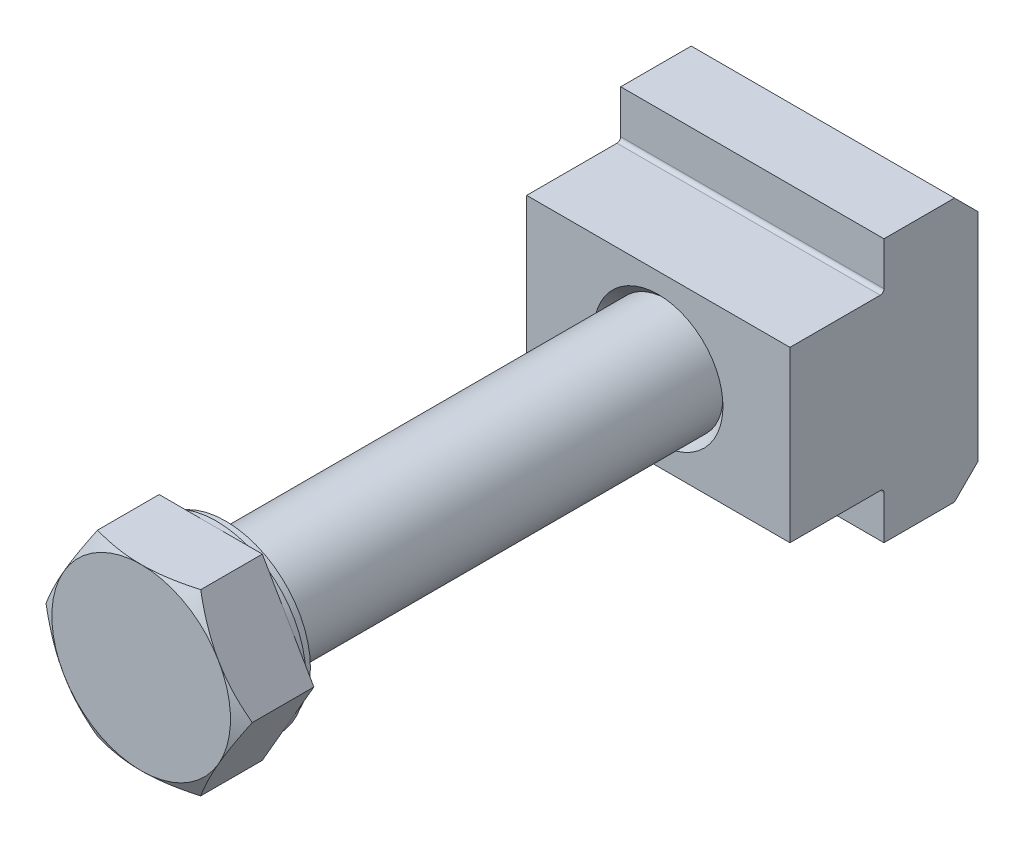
ISO-10303-21;
HEADER;
FILE_DESCRIPTION(('STEP AP214'),'2;1');
FILE_NAME('part.step','',(''),(''),'','','');
FILE_SCHEMA(('AUTOMOTIVE_DESIGN { 1 0 10303 214 1 1 1 1 }'));
ENDSEC;
DATA;
#1=APPLICATION_CONTEXT('core data for automotive mechanical design processes');
#2=APPLICATION_PROTOCOL_DEFINITION('international standard','automotive_design',2000,#1);
#3=PRODUCT_CONTEXT('',#1,'mechanical');
#4=PRODUCT('Part','Part','',(#3));
#5=PRODUCT_RELATED_PRODUCT_CATEGORY('part','',(#4));
#6=PRODUCT_DEFINITION_FORMATION('','',#4);
#7=PRODUCT_DEFINITION_CONTEXT('part definition',#1,'design');
#8=PRODUCT_DEFINITION('design','',#6,#7);
#9=PRODUCT_DEFINITION_SHAPE('','',#8);
#10=(LENGTH_UNIT() NAMED_UNIT(*) SI_UNIT(.MILLI.,.METRE.));
#11=(NAMED_UNIT(*) PLANE_ANGLE_UNIT() SI_UNIT($,.RADIAN.));
#12=(NAMED_UNIT(*) SI_UNIT($,.STERADIAN.) SOLID_ANGLE_UNIT());
#13=UNCERTAINTY_MEASURE_WITH_UNIT(LENGTH_MEASURE(1.E-05),#10,'distance_accuracy_value','');
#14=(GEOMETRIC_REPRESENTATION_CONTEXT(3) GLOBAL_UNCERTAINTY_ASSIGNED_CONTEXT((#13)) GLOBAL_UNIT_ASSIGNED_CONTEXT((#10,
#11,#12)) REPRESENTATION_CONTEXT('',''));
#15=CARTESIAN_POINT('',(0.,0.,0.));
#16=DIRECTION('',(0.,0.,1.));
#17=DIRECTION('',(1.,0.,0.));
#18=AXIS2_PLACEMENT_3D('',#15,#16,#17);
#19=CARTESIAN_POINT('',(0.,0.,1.));
#20=DIRECTION('',(0.,0.,-1.));
#21=DIRECTION('',(0.,-1.,0.));
#22=AXIS2_PLACEMENT_3D('',#19,#20,#21);
#23=CYLINDRICAL_SURFACE('',#22,9.);
#24=CARTESIAN_POINT('',(0.,0.,1.));
#25=DIRECTION('',(0.,0.,1.));
#26=DIRECTION('',(0.,1.,0.));
#27=AXIS2_PLACEMENT_3D('',#24,#25,#26);
#28=CIRCLE('',#27,9.);
#29=CARTESIAN_POINT('',(0.,9.,1.));
#30=VERTEX_POINT('',#29);
#31=EDGE_CURVE('E9',#30,#30,#28,.T.);
#32=ORIENTED_EDGE('',*,*,#31,.F.);
#33=EDGE_LOOP('',(#32));
#34=FACE_BOUND('',#33,.T.);
#35=CARTESIAN_POINT('',(0.,0.,0.));
#36=DIRECTION('',(0.,0.,1.));
#37=DIRECTION('',(0.,1.,0.));
#38=AXIS2_PLACEMENT_3D('',#35,#36,#37);
#39=CIRCLE('',#38,9.);
#40=CARTESIAN_POINT('',(0.,9.,0.));
#41=VERTEX_POINT('',#40);
#42=EDGE_CURVE('E24',#41,#41,#39,.T.);
#43=ORIENTED_EDGE('',*,*,#42,.T.);
#44=EDGE_LOOP('',(#43));
#45=FACE_BOUND('',#44,.T.);
#46=ADVANCED_FACE('F14',(#34,#45),#23,.T.);
#47=CARTESIAN_POINT('',(0.,0.,0.));
#48=DIRECTION('',(0.,0.,1.));
#49=DIRECTION('',(0.,1.,0.));
#50=AXIS2_PLACEMENT_3D('',#47,#48,#49);
#51=PLANE('',#50);
#52=ORIENTED_EDGE('',*,*,#42,.F.);
#53=EDGE_LOOP('',(#52));
#54=FACE_BOUND('',#53,.T.);
#55=CARTESIAN_POINT('',(0.,0.,0.));
#56=DIRECTION('',(0.,0.,1.));
#57=DIRECTION('',(0.,1.,0.));
#58=AXIS2_PLACEMENT_3D('',#55,#56,#57);
#59=CIRCLE('',#58,6.);
#60=CARTESIAN_POINT('',(0.,6.,0.));
#61=VERTEX_POINT('',#60);
#62=EDGE_CURVE('E276',#61,#61,#59,.T.);
#63=ORIENTED_EDGE('',*,*,#62,.T.);
#64=EDGE_LOOP('',(#63));
#65=FACE_BOUND('',#64,.T.);
#66=ADVANCED_FACE('F610',(#54,#65),#51,.F.);
#67=CARTESIAN_POINT('',(2.46325,0.,-59.));
#68=DIRECTION('',(0.,0.,-1.));
#69=DIRECTION('',(0.,1.,0.));
#70=AXIS2_PLACEMENT_3D('',#67,#68,#69);
#71=PLANE('',#70);
#72=CARTESIAN_POINT('',(0.,0.,-59.0000000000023));
#73=DIRECTION('',(0.,0.,1.));
#74=DIRECTION('',(0.,-1.,0.));
#75=AXIS2_PLACEMENT_3D('',#72,#73,#74);
#76=CIRCLE('',#75,4.92649999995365);
#77=CARTESIAN_POINT('',(0.,-4.92649999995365,-59.0000000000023));
#78=VERTEX_POINT('',#77);
#79=EDGE_CURVE('E280',#78,#78,#76,.T.);
#80=ORIENTED_EDGE('',*,*,#79,.F.);
#81=EDGE_LOOP('',(#80));
#82=FACE_BOUND('',#81,.T.);
#83=ADVANCED_FACE('F616',(#82),#71,.T.);
#84=CARTESIAN_POINT('',(0.,0.,-57.9264999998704));
#85=DIRECTION('',(0.,0.,1.));
#86=DIRECTION('',(0.,-1.,0.));
#87=AXIS2_PLACEMENT_3D('',#84,#85,#86);
#88=CONICAL_SURFACE('',#87,6.00000000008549,0.785398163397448);
#89=ORIENTED_EDGE('',*,*,#79,.T.);
#90=EDGE_LOOP('',(#89));
#91=FACE_BOUND('',#90,.T.);
#92=CARTESIAN_POINT('',(0.,0.,-58.8264999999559));
#93=DIRECTION('',(0.,0.,1.));
#94=DIRECTION('',(0.,1.,0.));
#95=AXIS2_PLACEMENT_3D('',#92,#93,#94);
#96=CIRCLE('',#95,5.1);
#97=CARTESIAN_POINT('',(0.,5.1,-58.8264999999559));
#98=VERTEX_POINT('',#97);
#99=EDGE_CURVE('E273',#98,#98,#96,.F.);
#100=ORIENTED_EDGE('',*,*,#99,.T.);
#101=EDGE_LOOP('',(#100));
#102=FACE_BOUND('',#101,.T.);
#103=ADVANCED_FACE('F647',(#91,#102),#88,.T.);
#104=CARTESIAN_POINT('',(0.,0.,-46.));
#105=DIRECTION('',(0.,0.,1.));
#106=DIRECTION('',(0.,1.,0.));
#107=AXIS2_PLACEMENT_3D('',#104,#105,#106);
#108=CYLINDRICAL_SURFACE('',#107,5.1);
#109=ORIENTED_EDGE('',*,*,#99,.F.);
#110=EDGE_LOOP('',(#109));
#111=FACE_BOUND('',#110,.T.);
#112=CARTESIAN_POINT('',(0.,0.,-64.225));
#113=DIRECTION('',(0.,0.,1.));
#114=DIRECTION('',(0.,1.,0.));
#115=AXIS2_PLACEMENT_3D('',#112,#113,#114);
#116=CIRCLE('',#115,5.1);
#117=CARTESIAN_POINT('',(0.,5.1,-64.225));
#118=VERTEX_POINT('',#117);
#119=EDGE_CURVE('E241',#118,#118,#116,.T.);
#120=ORIENTED_EDGE('',*,*,#119,.F.);
#121=EDGE_LOOP('',(#120));
#122=FACE_BOUND('',#121,.T.);
#123=ADVANCED_FACE('F643',(#111,#122),#108,.F.);
#124=CARTESIAN_POINT('',(0.,0.,-64.225));
#125=DIRECTION('',(0.,0.,-1.));
#126=DIRECTION('',(0.,-1.,0.));
#127=AXIS2_PLACEMENT_3D('',#124,#125,#126);
#128=CONICAL_SURFACE('',#127,5.1,0.785398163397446);
#129=CARTESIAN_POINT('',(0.,0.,-66.));
#130=DIRECTION('',(0.,0.,1.));
#131=DIRECTION('',(0.,1.,0.));
#132=AXIS2_PLACEMENT_3D('',#129,#130,#131);
#133=CIRCLE('',#132,6.875);
#134=CARTESIAN_POINT('',(0.,6.875,-66.));
#135=VERTEX_POINT('',#134);
#136=EDGE_CURVE('E238',#135,#135,#133,.T.);
#137=ORIENTED_EDGE('',*,*,#136,.F.);
#138=EDGE_LOOP('',(#137));
#139=FACE_BOUND('',#138,.T.);
#140=ORIENTED_EDGE('',*,*,#119,.T.);
#141=EDGE_LOOP('',(#140));
#142=FACE_BOUND('',#141,.T.);
#143=ADVANCED_FACE('F642',(#139,#142),#128,.F.);
#144=CARTESIAN_POINT('',(88.,9.4,-55.6));
#145=DIRECTION('',(1.,0.,0.));
#146=DIRECTION('',(0.,1.,0.));
#147=AXIS2_PLACEMENT_3D('',#144,#145,#146);
#148=CYLINDRICAL_SURFACE('',#147,0.4);
#149=DIRECTION('',(-1.,0.,0.));
#150=VECTOR('',#149,1.);
#151=CARTESIAN_POINT('',(-14.,9.,-55.6));
#152=LINE('',#151,#150);
#153=CARTESIAN_POINT('',(14.,9.,-55.6));
#154=VERTEX_POINT('',#153);
#155=CARTESIAN_POINT('',(-14.,9.,-55.6));
#156=VERTEX_POINT('',#155);
#157=EDGE_CURVE('E181',#154,#156,#152,.T.);
#158=ORIENTED_EDGE('',*,*,#157,.F.);
#159=CARTESIAN_POINT('',(14.,9.4,-55.6));
#160=DIRECTION('',(1.,0.,0.));
#161=DIRECTION('',(0.,-1.,0.));
#162=AXIS2_PLACEMENT_3D('',#159,#160,#161);
#163=CIRCLE('',#162,0.4);
#164=CARTESIAN_POINT('',(14.,9.4,-56.));
#165=VERTEX_POINT('',#164);
#166=EDGE_CURVE('E169',#154,#165,#163,.T.);
#167=ORIENTED_EDGE('',*,*,#166,.T.);
#168=DIRECTION('',(-1.,0.,0.));
#169=VECTOR('',#168,1.);
#170=CARTESIAN_POINT('',(88.,9.4,-56.));
#171=LINE('',#170,#169);
#172=CARTESIAN_POINT('',(-14.,9.4,-56.));
#173=VERTEX_POINT('',#172);
#174=EDGE_CURVE('E180',#173,#165,#171,.F.);
#175=ORIENTED_EDGE('',*,*,#174,.F.);
#176=CARTESIAN_POINT('',(-14.,9.4,-55.6));
#177=DIRECTION('',(-1.,0.,0.));
#178=DIRECTION('',(0.,-1.,0.));
#179=AXIS2_PLACEMENT_3D('',#176,#177,#178);
#180=CIRCLE('',#179,0.4);
#181=EDGE_CURVE('E18',#156,#173,#180,.F.);
#182=ORIENTED_EDGE('',*,*,#181,.F.);
#183=EDGE_LOOP('',(#158,#167,#175,#182));
#184=FACE_BOUND('',#183,.T.);
#185=ADVANCED_FACE('F16',(#184),#148,.F.);
#186=CARTESIAN_POINT('',(88.,14.,-56.));
#187=DIRECTION('',(0.,0.,1.));
#188=DIRECTION('',(0.,1.,0.));
#189=AXIS2_PLACEMENT_3D('',#186,#187,#188);
#190=PLANE('',#189);
#191=DIRECTION('',(0.,1.,0.));
#192=VECTOR('',#191,1.);
#193=CARTESIAN_POINT('',(14.,9.4,-56.));
#194=LINE('',#193,#192);
#195=CARTESIAN_POINT('',(14.,14.,-56.));
#196=VERTEX_POINT('',#195);
#197=EDGE_CURVE('E166',#165,#196,#194,.T.);
#198=ORIENTED_EDGE('',*,*,#197,.T.);
#199=DIRECTION('',(-1.,0.,0.));
#200=VECTOR('',#199,1.);
#201=CARTESIAN_POINT('',(88.,14.,-56.));
#202=LINE('',#201,#200);
#203=CARTESIAN_POINT('',(-14.,14.,-56.));
#204=VERTEX_POINT('',#203);
#205=EDGE_CURVE('E196',#196,#204,#202,.T.);
#206=ORIENTED_EDGE('',*,*,#205,.T.);
#207=DIRECTION('',(0.,1.,0.));
#208=VECTOR('',#207,1.);
#209=CARTESIAN_POINT('',(-14.,14.,-56.));
#210=LINE('',#209,#208);
#211=EDGE_CURVE('E185',#173,#204,#210,.T.);
#212=ORIENTED_EDGE('',*,*,#211,.F.);
#213=ORIENTED_EDGE('',*,*,#174,.T.);
#214=EDGE_LOOP('',(#198,#206,#212,#213));
#215=FACE_BOUND('',#214,.T.);
#216=ADVANCED_FACE('F184',(#215),#190,.T.);
#217=CARTESIAN_POINT('',(88.,14.,-56.));
#218=DIRECTION('',(0.,1.,0.));
#219=DIRECTION('',(0.,0.,-1.));
#220=AXIS2_PLACEMENT_3D('',#217,#218,#219);
#221=PLANE('',#220);
#222=DIRECTION('',(0.,0.,-1.));
#223=VECTOR('',#222,1.);
#224=CARTESIAN_POINT('',(14.,14.,-56.));
#225=LINE('',#224,#223);
#226=CARTESIAN_POINT('',(14.,14.,-63.5));
#227=VERTEX_POINT('',#226);
#228=EDGE_CURVE('E172',#196,#227,#225,.T.);
#229=ORIENTED_EDGE('',*,*,#228,.T.);
#230=DIRECTION('',(-1.,0.,0.));
#231=VECTOR('',#230,1.);
#232=CARTESIAN_POINT('',(88.,14.,-63.5));
#233=LINE('',#232,#231);
#234=CARTESIAN_POINT('',(-14.,14.,-63.5));
#235=VERTEX_POINT('',#234);
#236=EDGE_CURVE('E198',#227,#235,#233,.T.);
#237=ORIENTED_EDGE('',*,*,#236,.T.);
#238=DIRECTION('',(0.,0.,-1.));
#239=VECTOR('',#238,1.);
#240=CARTESIAN_POINT('',(-14.,14.,-56.));
#241=LINE('',#240,#239);
#242=EDGE_CURVE('E232',#204,#235,#241,.T.);
#243=ORIENTED_EDGE('',*,*,#242,.F.);
#244=ORIENTED_EDGE('',*,*,#205,.F.);
#245=EDGE_LOOP('',(#229,#237,#243,#244));
#246=FACE_BOUND('',#245,.T.);
#247=ADVANCED_FACE('F912',(#246),#221,.T.);
#248=CARTESIAN_POINT('',(88.,14.,-63.5));
#249=DIRECTION('',(0.,0.707106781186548,-0.707106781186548));
#250=DIRECTION('',(0.,-0.707106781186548,-0.707106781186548));
#251=AXIS2_PLACEMENT_3D('',#248,#249,#250);
#252=PLANE('',#251);
#253=DIRECTION('',(0.,-0.707106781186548,-0.707106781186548));
#254=VECTOR('',#253,1.);
#255=CARTESIAN_POINT('',(14.,14.,-63.5));
#256=LINE('',#255,#254);
#257=CARTESIAN_POINT('',(14.,11.5,-66.));
#258=VERTEX_POINT('',#257);
#259=EDGE_CURVE('E265',#227,#258,#256,.T.);
#260=ORIENTED_EDGE('',*,*,#259,.T.);
#261=DIRECTION('',(-1.,0.,0.));
#262=VECTOR('',#261,1.);
#263=CARTESIAN_POINT('',(88.,11.5,-66.));
#264=LINE('',#263,#262);
#265=CARTESIAN_POINT('',(-14.,11.5,-66.));
#266=VERTEX_POINT('',#265);
#267=EDGE_CURVE('E201',#258,#266,#264,.T.);
#268=ORIENTED_EDGE('',*,*,#267,.T.);
#269=DIRECTION('',(0.,-0.707106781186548,-0.707106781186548));
#270=VECTOR('',#269,1.);
#271=CARTESIAN_POINT('',(-14.,14.,-63.5));
#272=LINE('',#271,#270);
#273=EDGE_CURVE('E229',#235,#266,#272,.T.);
#274=ORIENTED_EDGE('',*,*,#273,.F.);
#275=ORIENTED_EDGE('',*,*,#236,.F.);
#276=EDGE_LOOP('',(#260,#268,#274,#275));
#277=FACE_BOUND('',#276,.T.);
#278=ADVANCED_FACE('F902',(#277),#252,.T.);
#279=CARTESIAN_POINT('',(88.,11.5,-66.));
#280=DIRECTION('',(0.,0.,-1.));
#281=DIRECTION('',(0.,-1.,0.));
#282=AXIS2_PLACEMENT_3D('',#279,#280,#281);
#283=PLANE('',#282);
#284=DIRECTION('',(0.,-1.,0.));
#285=VECTOR('',#284,1.);
#286=CARTESIAN_POINT('',(14.,11.5,-66.));
#287=LINE('',#286,#285);
#288=CARTESIAN_POINT('',(14.,-11.5,-66.));
#289=VERTEX_POINT('',#288);
#290=EDGE_CURVE('E262',#258,#289,#287,.T.);
#291=ORIENTED_EDGE('',*,*,#290,.T.);
#292=DIRECTION('',(-1.,0.,0.));
#293=VECTOR('',#292,1.);
#294=CARTESIAN_POINT('',(88.,-11.5,-66.));
#295=LINE('',#294,#293);
#296=CARTESIAN_POINT('',(-14.,-11.5,-66.));
#297=VERTEX_POINT('',#296);
#298=EDGE_CURVE('E203',#289,#297,#295,.T.);
#299=ORIENTED_EDGE('',*,*,#298,.T.);
#300=DIRECTION('',(0.,-1.,0.));
#301=VECTOR('',#300,1.);
#302=CARTESIAN_POINT('',(-14.,11.5,-66.));
#303=LINE('',#302,#301);
#304=EDGE_CURVE('E226',#266,#297,#303,.T.);
#305=ORIENTED_EDGE('',*,*,#304,.F.);
#306=ORIENTED_EDGE('',*,*,#267,.F.);
#307=EDGE_LOOP('',(#291,#299,#305,#306));
#308=FACE_BOUND('',#307,.T.);
#309=ORIENTED_EDGE('',*,*,#136,.T.);
#310=EDGE_LOOP('',(#309));
#311=FACE_BOUND('',#310,.T.);
#312=ADVANCED_FACE('F892',(#308,#311),#283,.T.);
#313=CARTESIAN_POINT('',(88.,-14.,-63.5));
#314=DIRECTION('',(0.,-0.707106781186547,-0.707106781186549));
#315=DIRECTION('',(0.,-0.707106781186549,0.707106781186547));
#316=AXIS2_PLACEMENT_3D('',#313,#314,#315);
#317=PLANE('',#316);
#318=DIRECTION('',(0.,-0.707106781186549,0.707106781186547));
#319=VECTOR('',#318,1.);
#320=CARTESIAN_POINT('',(14.,-11.5,-66.));
#321=LINE('',#320,#319);
#322=CARTESIAN_POINT('',(14.,-14.,-63.5));
#323=VERTEX_POINT('',#322);
#324=EDGE_CURVE('E259',#289,#323,#321,.T.);
#325=ORIENTED_EDGE('',*,*,#324,.T.);
#326=DIRECTION('',(-1.,0.,0.));
#327=VECTOR('',#326,1.);
#328=CARTESIAN_POINT('',(88.,-14.,-63.5));
#329=LINE('',#328,#327);
#330=CARTESIAN_POINT('',(-14.,-14.,-63.5));
#331=VERTEX_POINT('',#330);
#332=EDGE_CURVE('E205',#323,#331,#329,.T.);
#333=ORIENTED_EDGE('',*,*,#332,.T.);
#334=DIRECTION('',(0.,-0.707106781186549,0.707106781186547));
#335=VECTOR('',#334,1.);
#336=CARTESIAN_POINT('',(-14.,-14.,-63.5));
#337=LINE('',#336,#335);
#338=EDGE_CURVE('E223',#297,#331,#337,.T.);
#339=ORIENTED_EDGE('',*,*,#338,.F.);
#340=ORIENTED_EDGE('',*,*,#298,.F.);
#341=EDGE_LOOP('',(#325,#333,#339,#340));
#342=FACE_BOUND('',#341,.T.);
#343=ADVANCED_FACE('F882',(#342),#317,.T.);
#344=CARTESIAN_POINT('',(88.,-14.,-56.));
#345=DIRECTION('',(0.,-1.,0.));
#346=DIRECTION('',(0.,0.,1.));
#347=AXIS2_PLACEMENT_3D('',#344,#345,#346);
#348=PLANE('',#347);
#349=DIRECTION('',(0.,0.,1.));
#350=VECTOR('',#349,1.);
#351=CARTESIAN_POINT('',(14.,-14.,-63.5));
#352=LINE('',#351,#350);
#353=CARTESIAN_POINT('',(14.,-14.,-56.));
#354=VERTEX_POINT('',#353);
#355=EDGE_CURVE('E256',#323,#354,#352,.T.);
#356=ORIENTED_EDGE('',*,*,#355,.T.);
#357=DIRECTION('',(-1.,0.,0.));
#358=VECTOR('',#357,1.);
#359=CARTESIAN_POINT('',(88.,-14.,-56.));
#360=LINE('',#359,#358);
#361=CARTESIAN_POINT('',(-14.,-14.,-56.));
#362=VERTEX_POINT('',#361);
#363=EDGE_CURVE('E207',#354,#362,#360,.T.);
#364=ORIENTED_EDGE('',*,*,#363,.T.);
#365=DIRECTION('',(0.,0.,1.));
#366=VECTOR('',#365,1.);
#367=CARTESIAN_POINT('',(-14.,-14.,-56.));
#368=LINE('',#367,#366);
#369=EDGE_CURVE('E220',#331,#362,#368,.T.);
#370=ORIENTED_EDGE('',*,*,#369,.F.);
#371=ORIENTED_EDGE('',*,*,#332,.F.);
#372=EDGE_LOOP('',(#356,#364,#370,#371));
#373=FACE_BOUND('',#372,.T.);
#374=ADVANCED_FACE('F865',(#373),#348,.T.);
#375=CARTESIAN_POINT('',(88.,-9.,-56.));
#376=DIRECTION('',(0.,0.,1.));
#377=DIRECTION('',(0.,1.,0.));
#378=AXIS2_PLACEMENT_3D('',#375,#376,#377);
#379=PLANE('',#378);
#380=DIRECTION('',(0.,1.,0.));
#381=VECTOR('',#380,1.);
#382=CARTESIAN_POINT('',(14.,-14.,-56.));
#383=LINE('',#382,#381);
#384=CARTESIAN_POINT('',(14.,-9.4,-56.));
#385=VERTEX_POINT('',#384);
#386=EDGE_CURVE('E253',#354,#385,#383,.T.);
#387=ORIENTED_EDGE('',*,*,#386,.T.);
#388=DIRECTION('',(-1.,0.,0.));
#389=VECTOR('',#388,1.);
#390=CARTESIAN_POINT('',(-14.,-9.4,-56.));
#391=LINE('',#390,#389);
#392=CARTESIAN_POINT('',(-14.,-9.4,-56.));
#393=VERTEX_POINT('',#392);
#394=EDGE_CURVE('E193',#385,#393,#391,.T.);
#395=ORIENTED_EDGE('',*,*,#394,.T.);
#396=DIRECTION('',(0.,1.,0.));
#397=VECTOR('',#396,1.);
#398=CARTESIAN_POINT('',(-14.,-9.,-56.));
#399=LINE('',#398,#397);
#400=EDGE_CURVE('E217',#362,#393,#399,.T.);
#401=ORIENTED_EDGE('',*,*,#400,.F.);
#402=ORIENTED_EDGE('',*,*,#363,.F.);
#403=EDGE_LOOP('',(#387,#395,#401,#402));
#404=FACE_BOUND('',#403,.T.);
#405=ADVANCED_FACE('F856',(#404),#379,.T.);
#406=CARTESIAN_POINT('',(88.,-9.4,-55.6));
#407=DIRECTION('',(1.,0.,0.));
#408=DIRECTION('',(0.,1.,0.));
#409=AXIS2_PLACEMENT_3D('',#406,#407,#408);
#410=CYLINDRICAL_SURFACE('',#409,0.4);
#411=ORIENTED_EDGE('',*,*,#394,.F.);
#412=CARTESIAN_POINT('',(14.,-9.4,-55.6));
#413=DIRECTION('',(1.,0.,0.));
#414=DIRECTION('',(0.,-1.,0.));
#415=AXIS2_PLACEMENT_3D('',#412,#413,#414);
#416=CIRCLE('',#415,0.4);
#417=CARTESIAN_POINT('',(14.,-9.,-55.6));
#418=VERTEX_POINT('',#417);
#419=EDGE_CURVE('E250',#385,#418,#416,.T.);
#420=ORIENTED_EDGE('',*,*,#419,.T.);
#421=DIRECTION('',(-1.,0.,0.));
#422=VECTOR('',#421,1.);
#423=CARTESIAN_POINT('',(88.,-9.,-55.6));
#424=LINE('',#423,#422);
#425=CARTESIAN_POINT('',(-14.,-9.,-55.6));
#426=VERTEX_POINT('',#425);
#427=EDGE_CURVE('E188',#426,#418,#424,.F.);
#428=ORIENTED_EDGE('',*,*,#427,.F.);
#429=CARTESIAN_POINT('',(-14.,-9.4,-55.6));
#430=DIRECTION('',(-1.,0.,0.));
#431=DIRECTION('',(0.,-1.,0.));
#432=AXIS2_PLACEMENT_3D('',#429,#430,#431);
#433=CIRCLE('',#432,0.4);
#434=EDGE_CURVE('E186',#393,#426,#433,.F.);
#435=ORIENTED_EDGE('',*,*,#434,.F.);
#436=EDGE_LOOP('',(#411,#420,#428,#435));
#437=FACE_BOUND('',#436,.T.);
#438=ADVANCED_FACE('F853',(#437),#410,.F.);
#439=CARTESIAN_POINT('',(88.,-9.,-46.));
#440=DIRECTION('',(0.,-1.,0.));
#441=DIRECTION('',(0.,0.,1.));
#442=AXIS2_PLACEMENT_3D('',#439,#440,#441);
#443=PLANE('',#442);
#444=DIRECTION('',(0.,0.,1.));
#445=VECTOR('',#444,1.);
#446=CARTESIAN_POINT('',(14.,-9.,-55.6));
#447=LINE('',#446,#445);
#448=CARTESIAN_POINT('',(14.,-9.,-46.));
#449=VERTEX_POINT('',#448);
#450=EDGE_CURVE('E247',#418,#449,#447,.T.);
#451=ORIENTED_EDGE('',*,*,#450,.T.);
#452=DIRECTION('',(-1.,0.,0.));
#453=VECTOR('',#452,1.);
#454=CARTESIAN_POINT('',(88.,-9.,-46.));
#455=LINE('',#454,#453);
#456=CARTESIAN_POINT('',(-14.,-9.,-46.));
#457=VERTEX_POINT('',#456);
#458=EDGE_CURVE('E209',#449,#457,#455,.T.);
#459=ORIENTED_EDGE('',*,*,#458,.T.);
#460=DIRECTION('',(0.,0.,1.));
#461=VECTOR('',#460,1.);
#462=CARTESIAN_POINT('',(-14.,-9.,-46.));
#463=LINE('',#462,#461);
#464=EDGE_CURVE('E214',#426,#457,#463,.T.);
#465=ORIENTED_EDGE('',*,*,#464,.F.);
#466=ORIENTED_EDGE('',*,*,#427,.T.);
#467=EDGE_LOOP('',(#451,#459,#465,#466));
#468=FACE_BOUND('',#467,.T.);
#469=ADVANCED_FACE('F820',(#468),#443,.T.);
#470=CARTESIAN_POINT('',(-14.,9.,-56.));
#471=DIRECTION('',(-1.,0.,0.));
#472=DIRECTION('',(0.,-1.,0.));
#473=AXIS2_PLACEMENT_3D('',#470,#471,#472);
#474=PLANE('',#473);
#475=DIRECTION('',(0.,0.,-1.));
#476=VECTOR('',#475,1.);
#477=CARTESIAN_POINT('',(-14.,9.,-46.));
#478=LINE('',#477,#476);
#479=CARTESIAN_POINT('',(-14.,9.,-46.));
#480=VERTEX_POINT('',#479);
#481=EDGE_CURVE('E236',#480,#156,#478,.T.);
#482=ORIENTED_EDGE('',*,*,#481,.T.);
#483=ORIENTED_EDGE('',*,*,#181,.T.);
#484=ORIENTED_EDGE('',*,*,#211,.T.);
#485=ORIENTED_EDGE('',*,*,#242,.T.);
#486=ORIENTED_EDGE('',*,*,#273,.T.);
#487=ORIENTED_EDGE('',*,*,#304,.T.);
#488=ORIENTED_EDGE('',*,*,#338,.T.);
#489=ORIENTED_EDGE('',*,*,#369,.T.);
#490=ORIENTED_EDGE('',*,*,#400,.T.);
#491=ORIENTED_EDGE('',*,*,#434,.T.);
#492=ORIENTED_EDGE('',*,*,#464,.T.);
#493=DIRECTION('',(0.,1.,0.));
#494=VECTOR('',#493,1.);
#495=CARTESIAN_POINT('',(-14.,9.,-46.));
#496=LINE('',#495,#494);
#497=EDGE_CURVE('E199',#457,#480,#496,.T.);
#498=ORIENTED_EDGE('',*,*,#497,.T.);
#499=EDGE_LOOP('',(#482,#483,#484,#485,#486,#487,#488,#489,#490,#491,#492,#498));
#500=FACE_BOUND('',#499,.T.);
#501=ADVANCED_FACE('F835',(#500),#474,.T.);
#502=CARTESIAN_POINT('',(88.,9.,-46.));
#503=DIRECTION('',(0.,1.,0.));
#504=DIRECTION('',(0.,0.,-1.));
#505=AXIS2_PLACEMENT_3D('',#502,#503,#504);
#506=PLANE('',#505);
#507=DIRECTION('',(0.,0.,-1.));
#508=VECTOR('',#507,1.);
#509=CARTESIAN_POINT('',(14.,9.,-46.));
#510=LINE('',#509,#508);
#511=CARTESIAN_POINT('',(14.,9.,-46.));
#512=VERTEX_POINT('',#511);
#513=EDGE_CURVE('E182',#512,#154,#510,.T.);
#514=ORIENTED_EDGE('',*,*,#513,.T.);
#515=ORIENTED_EDGE('',*,*,#157,.T.);
#516=ORIENTED_EDGE('',*,*,#481,.F.);
#517=DIRECTION('',(-1.,0.,0.));
#518=VECTOR('',#517,1.);
#519=CARTESIAN_POINT('',(88.,9.,-46.));
#520=LINE('',#519,#518);
#521=EDGE_CURVE('E195',#512,#480,#520,.T.);
#522=ORIENTED_EDGE('',*,*,#521,.F.);
#523=EDGE_LOOP('',(#514,#515,#516,#522));
#524=FACE_BOUND('',#523,.T.);
#525=ADVANCED_FACE('F655',(#524),#506,.T.);
#526=CARTESIAN_POINT('',(14.,9.4,-55.6));
#527=DIRECTION('',(-1.,0.,0.));
#528=DIRECTION('',(0.,-1.,0.));
#529=AXIS2_PLACEMENT_3D('',#526,#527,#528);
#530=PLANE('',#529);
#531=DIRECTION('',(0.,1.,0.));
#532=VECTOR('',#531,1.);
#533=CARTESIAN_POINT('',(14.,-9.,-46.));
#534=LINE('',#533,#532);
#535=EDGE_CURVE('E270',#449,#512,#534,.T.);
#536=ORIENTED_EDGE('',*,*,#535,.F.);
#537=ORIENTED_EDGE('',*,*,#450,.F.);
#538=ORIENTED_EDGE('',*,*,#419,.F.);
#539=ORIENTED_EDGE('',*,*,#386,.F.);
#540=ORIENTED_EDGE('',*,*,#355,.F.);
#541=ORIENTED_EDGE('',*,*,#324,.F.);
#542=ORIENTED_EDGE('',*,*,#290,.F.);
#543=ORIENTED_EDGE('',*,*,#259,.F.);
#544=ORIENTED_EDGE('',*,*,#228,.F.);
#545=ORIENTED_EDGE('',*,*,#197,.F.);
#546=ORIENTED_EDGE('',*,*,#166,.F.);
#547=ORIENTED_EDGE('',*,*,#513,.F.);
#548=EDGE_LOOP('',(#536,#537,#538,#539,#540,#541,#542,#543,#544,#545,#546,#547));
#549=FACE_BOUND('',#548,.T.);
#550=ADVANCED_FACE('F168',(#549),#530,.F.);
#551=CARTESIAN_POINT('',(88.,9.,-46.));
#552=DIRECTION('',(0.,0.,1.));
#553=DIRECTION('',(0.,1.,0.));
#554=AXIS2_PLACEMENT_3D('',#551,#552,#553);
#555=PLANE('',#554);
#556=ORIENTED_EDGE('',*,*,#535,.T.);
#557=ORIENTED_EDGE('',*,*,#521,.T.);
#558=ORIENTED_EDGE('',*,*,#497,.F.);
#559=ORIENTED_EDGE('',*,*,#458,.F.);
#560=EDGE_LOOP('',(#556,#557,#558,#559));
#561=FACE_BOUND('',#560,.T.);
#562=CARTESIAN_POINT('',(0.,0.,-46.));
#563=DIRECTION('',(0.,0.,1.));
#564=DIRECTION('',(0.,1.,0.));
#565=AXIS2_PLACEMENT_3D('',#562,#563,#564);
#566=CIRCLE('',#565,6.875);
#567=CARTESIAN_POINT('',(0.,6.875,-46.));
#568=VERTEX_POINT('',#567);
#569=EDGE_CURVE('E244',#568,#568,#566,.T.);
#570=ORIENTED_EDGE('',*,*,#569,.F.);
#571=EDGE_LOOP('',(#570));
#572=FACE_BOUND('',#571,.T.);
#573=ADVANCED_FACE('F639',(#561,#572),#555,.T.);
#574=CARTESIAN_POINT('',(0.,0.,-46.));
#575=DIRECTION('',(0.,0.,1.));
#576=DIRECTION('',(0.,1.,0.));
#577=AXIS2_PLACEMENT_3D('',#574,#575,#576);
#578=CONICAL_SURFACE('',#577,6.875,0.785398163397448);
#579=CARTESIAN_POINT('',(0.,0.,-46.875));
#580=DIRECTION('',(0.,0.,1.));
#581=DIRECTION('',(0.,1.,0.));
#582=AXIS2_PLACEMENT_3D('',#579,#580,#581);
#583=CIRCLE('',#582,6.);
#584=CARTESIAN_POINT('',(0.,6.,-46.875));
#585=VERTEX_POINT('',#584);
#586=EDGE_CURVE('E277',#585,#585,#583,.T.);
#587=ORIENTED_EDGE('',*,*,#586,.F.);
#588=EDGE_LOOP('',(#587));
#589=FACE_BOUND('',#588,.T.);
#590=ORIENTED_EDGE('',*,*,#569,.T.);
#591=EDGE_LOOP('',(#590));
#592=FACE_BOUND('',#591,.T.);
#593=ADVANCED_FACE('F630',(#589,#592),#578,.F.);
#594=CARTESIAN_POINT('',(0.,0.,-28.76325));
#595=DIRECTION('',(0.,0.,-1.));
#596=DIRECTION('',(0.,1.,0.));
#597=AXIS2_PLACEMENT_3D('',#594,#595,#596);
#598=CYLINDRICAL_SURFACE('',#597,6.);
#599=ORIENTED_EDGE('',*,*,#586,.T.);
#600=EDGE_LOOP('',(#599));
#601=FACE_BOUND('',#600,.T.);
#602=ORIENTED_EDGE('',*,*,#62,.F.);
#603=EDGE_LOOP('',(#602));
#604=FACE_BOUND('',#603,.T.);
#605=ADVANCED_FACE('F628',(#601,#604),#598,.T.);
#606=CARTESIAN_POINT('',(4.75,0.,9.));
#607=DIRECTION('',(0.,0.,1.));
#608=DIRECTION('',(0.,-1.,0.));
#609=AXIS2_PLACEMENT_3D('',#606,#607,#608);
#610=PLANE('',#609);
#611=CARTESIAN_POINT('',(0.,0.,9.));
#612=DIRECTION('',(0.,0.,-1.));
#613=DIRECTION('',(0.,1.,0.));
#614=AXIS2_PLACEMENT_3D('',#611,#612,#613);
#615=CIRCLE('',#614,9.5);
#616=CARTESIAN_POINT('',(0.,-9.5,9.));
#617=VERTEX_POINT('',#616);
#618=CARTESIAN_POINT('',(-8.22724133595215,-4.75,9.));
#619=VERTEX_POINT('',#618);
#620=EDGE_CURVE('E293',#617,#619,#615,.T.);
#621=ORIENTED_EDGE('',*,*,#620,.F.);
#622=CARTESIAN_POINT('',(0.,0.,9.));
#623=DIRECTION('',(0.,0.,-1.));
#624=DIRECTION('',(0.,1.,0.));
#625=AXIS2_PLACEMENT_3D('',#622,#623,#624);
#626=CIRCLE('',#625,9.5);
#627=CARTESIAN_POINT('',(8.22724133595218,-4.75,9.));
#628=VERTEX_POINT('',#627);
#629=EDGE_CURVE('E287',#628,#617,#626,.T.);
#630=ORIENTED_EDGE('',*,*,#629,.F.);
#631=CARTESIAN_POINT('',(0.,0.,9.));
#632=DIRECTION('',(0.,0.,-1.));
#633=DIRECTION('',(0.,1.,0.));
#634=AXIS2_PLACEMENT_3D('',#631,#632,#633);
#635=CIRCLE('',#634,9.5);
#636=CARTESIAN_POINT('',(8.2272413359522,4.75,9.));
#637=VERTEX_POINT('',#636);
#638=EDGE_CURVE('E284',#637,#628,#635,.T.);
#639=ORIENTED_EDGE('',*,*,#638,.F.);
#640=CARTESIAN_POINT('',(0.,0.,9.));
#641=DIRECTION('',(0.,0.,-1.));
#642=DIRECTION('',(0.,1.,0.));
#643=AXIS2_PLACEMENT_3D('',#640,#641,#642);
#644=CIRCLE('',#643,9.5);
#645=CARTESIAN_POINT('',(0.,9.5,9.));
#646=VERTEX_POINT('',#645);
#647=EDGE_CURVE('E281',#646,#637,#644,.T.);
#648=ORIENTED_EDGE('',*,*,#647,.F.);
#649=CARTESIAN_POINT('',(0.,0.,9.));
#650=DIRECTION('',(0.,0.,-1.));
#651=DIRECTION('',(0.,1.,0.));
#652=AXIS2_PLACEMENT_3D('',#649,#650,#651);
#653=CIRCLE('',#652,9.5);
#654=CARTESIAN_POINT('',(-8.22724133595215,4.75,9.));
#655=VERTEX_POINT('',#654);
#656=EDGE_CURVE('E290',#655,#646,#653,.T.);
#657=ORIENTED_EDGE('',*,*,#656,.F.);
#658=CARTESIAN_POINT('',(0.,0.,9.));
#659=DIRECTION('',(0.,0.,-1.));
#660=DIRECTION('',(0.,1.,0.));
#661=AXIS2_PLACEMENT_3D('',#658,#659,#660);
#662=CIRCLE('',#661,9.5);
#663=EDGE_CURVE('E296',#619,#655,#662,.T.);
#664=ORIENTED_EDGE('',*,*,#663,.F.);
#665=EDGE_LOOP('',(#621,#630,#639,#648,#657,#664));
#666=FACE_BOUND('',#665,.T.);
#667=ADVANCED_FACE('F326',(#666),#610,.T.);
#668=CARTESIAN_POINT('',(0.,0.,8.1464031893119));
#669=DIRECTION('',(0.,0.,-1.));
#670=DIRECTION('',(0.,1.,0.));
#671=AXIS2_PLACEMENT_3D('',#668,#669,#670);
#672=CONICAL_SURFACE('',#671,10.9784730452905,1.0471975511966);
#673=CARTESIAN_POINT('',(-10.9696551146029,0.,8.1514942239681));
#674=CARTESIAN_POINT('',(-10.7464238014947,-0.386647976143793,8.28040921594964));
#675=CARTESIAN_POINT('',(-10.5214047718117,-0.776392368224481,8.3985178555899));
#676=CARTESIAN_POINT('',(-10.0693831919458,-1.55931671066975,8.60680031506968));
#677=CARTESIAN_POINT('',(-9.84239640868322,-1.95246935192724,8.69711226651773));
#678=CARTESIAN_POINT('',(-9.4997740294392,-2.54590872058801,8.80800000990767));
#679=CARTESIAN_POINT('',(-9.38513376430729,-2.74447148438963,8.84087935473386));
#680=CARTESIAN_POINT('',(-9.15530440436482,-3.14254761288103,8.89779418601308));
#681=CARTESIAN_POINT('',(-9.04011532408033,-3.3420609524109,8.92182990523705));
#682=CARTESIAN_POINT('',(-8.80876226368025,-3.7427762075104,8.96063517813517));
#683=CARTESIAN_POINT('',(-8.69259629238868,-3.94398157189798,8.97535760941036));
#684=CARTESIAN_POINT('',(-8.46003588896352,-4.34678800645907,8.99506039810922));
#685=CARTESIAN_POINT('',(-8.3436414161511,-4.54838914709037,9.00003882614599));
#686=CARTESIAN_POINT('',(-8.22724133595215,-4.75,9.));
#687=B_SPLINE_CURVE_WITH_KNOTS('',3,(#673,#674,#675,#676,#677,#678,#679,#680,#681,#682,#683,
#684,#685,#686),.UNSPECIFIED.,.F.,.F.,(4,2,2,2,2,2,4),(0.,1.39466965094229,2.78229242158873,
3.47701423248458,4.17171775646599,4.86990873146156,5.56823793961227),.UNSPECIFIED.);
#688=CARTESIAN_POINT('',(-10.9696551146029,0.,8.1514942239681));
#689=VERTEX_POINT('',#688);
#690=EDGE_CURVE('E425',#689,#619,#687,.T.);
#691=ORIENTED_EDGE('',*,*,#690,.T.);
#692=ORIENTED_EDGE('',*,*,#663,.T.);
#693=CARTESIAN_POINT('',(-8.22724133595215,4.75,9.));
#694=CARTESIAN_POINT('',(-8.34364141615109,4.54838914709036,9.00003882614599));
#695=CARTESIAN_POINT('',(-8.46003588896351,4.34678800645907,8.99506039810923));
#696=CARTESIAN_POINT('',(-8.69259629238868,3.94398157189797,8.97535760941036));
#697=CARTESIAN_POINT('',(-8.80876226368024,3.7427762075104,8.96063517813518));
#698=CARTESIAN_POINT('',(-9.04011532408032,3.3420609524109,8.92182990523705));
#699=CARTESIAN_POINT('',(-9.15530440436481,3.14254761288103,8.89779418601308));
#700=CARTESIAN_POINT('',(-9.38513376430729,2.74447148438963,8.84087935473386));
#701=CARTESIAN_POINT('',(-9.49977402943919,2.54590872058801,8.80800000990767));
#702=CARTESIAN_POINT('',(-9.84239640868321,1.95246935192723,8.69711226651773));
#703=CARTESIAN_POINT('',(-10.0693831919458,1.55931671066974,8.60680031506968));
#704=CARTESIAN_POINT('',(-10.5214047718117,0.776392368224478,8.3985178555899));
#705=CARTESIAN_POINT('',(-10.7464238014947,0.386647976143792,8.28040921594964));
#706=CARTESIAN_POINT('',(-10.9696551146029,0.,8.1514942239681));
#707=B_SPLINE_CURVE_WITH_KNOTS('',3,(#693,#694,#695,#696,#697,#698,#699,#700,#701,#702,#703,
#704,#705,#706),.UNSPECIFIED.,.F.,.F.,(4,2,2,2,2,2,4),(0.,0.698329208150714,1.39652018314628,
2.09122370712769,2.78594551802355,4.17356828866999,5.56823793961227),.UNSPECIFIED.);
#708=EDGE_CURVE('E400',#655,#689,#707,.T.);
#709=ORIENTED_EDGE('',*,*,#708,.T.);
#710=EDGE_LOOP('',(#691,#692,#709));
#711=FACE_BOUND('',#710,.T.);
#712=ADVANCED_FACE('F448',(#711),#672,.T.);
#713=CARTESIAN_POINT('',(0.,0.,8.14640318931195));
#714=DIRECTION('',(0.,0.,-1.));
#715=DIRECTION('',(0.,1.,0.));
#716=AXIS2_PLACEMENT_3D('',#713,#714,#715);
#717=CONICAL_SURFACE('',#716,10.9784730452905,1.0471975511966);
#718=CARTESIAN_POINT('',(-5.48482755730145,-9.5,8.1514942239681));
#719=CARTESIAN_POINT('',(-5.03836493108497,-9.5,8.28040921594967));
#720=CARTESIAN_POINT('',(-4.58832687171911,-9.5,8.39851785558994));
#721=CARTESIAN_POINT('',(-3.68428371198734,-9.5,8.60680031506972));
#722=CARTESIAN_POINT('',(-3.23031014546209,-9.5,8.69711226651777));
#723=CARTESIAN_POINT('',(-2.54506538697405,-9.5,8.80800000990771));
#724=CARTESIAN_POINT('',(-2.31578485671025,-9.5,8.8408793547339));
#725=CARTESIAN_POINT('',(-1.8561261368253,-9.5,8.89779418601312));
#726=CARTESIAN_POINT('',(-1.62574797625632,-9.5,8.92182990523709));
#727=CARTESIAN_POINT('',(-1.16304185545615,-9.5,8.96063517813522));
#728=CARTESIAN_POINT('',(-0.930709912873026,-9.5,8.97535760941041));
#729=CARTESIAN_POINT('',(-0.465589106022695,-9.5,8.99506039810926));
#730=CARTESIAN_POINT('',(-0.232800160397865,-9.5,9.00003882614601));
#731=CARTESIAN_POINT('',(0.,-9.5,9.));
#732=B_SPLINE_CURVE_WITH_KNOTS('',3,(#718,#719,#720,#721,#722,#723,#724,#725,#726,#727,#728,
#729,#730,#731),.UNSPECIFIED.,.F.,.F.,(4,2,2,2,2,2,4),(0.,1.39466965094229,2.78229242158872,
3.47701423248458,4.17171775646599,4.86990873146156,5.56823793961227),.UNSPECIFIED.);
#733=CARTESIAN_POINT('',(-5.48482755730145,-9.5,8.1514942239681));
#734=VERTEX_POINT('',#733);
#735=EDGE_CURVE('E407',#734,#617,#732,.T.);
#736=ORIENTED_EDGE('',*,*,#735,.T.);
#737=ORIENTED_EDGE('',*,*,#620,.T.);
#738=CARTESIAN_POINT('',(-8.22724133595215,-4.75,9.));
#739=CARTESIAN_POINT('',(-8.11084125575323,-4.95161085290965,9.00003882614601));
#740=CARTESIAN_POINT('',(-7.99444678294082,-5.15321199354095,8.99506039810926));
#741=CARTESIAN_POINT('',(-7.76188637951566,-5.55601842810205,8.9753576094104));
#742=CARTESIAN_POINT('',(-7.6457204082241,-5.75722379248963,8.96063517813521));
#743=CARTESIAN_POINT('',(-7.41436734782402,-6.15793904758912,8.92182990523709));
#744=CARTESIAN_POINT('',(-7.29917826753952,-6.35745238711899,8.89779418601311));
#745=CARTESIAN_POINT('',(-7.06934890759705,-6.75552851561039,8.84087935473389));
#746=CARTESIAN_POINT('',(-6.95470864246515,-6.95409127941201,8.8080000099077));
#747=CARTESIAN_POINT('',(-6.61208626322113,-7.54753064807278,8.69711226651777));
#748=CARTESIAN_POINT('',(-6.38509947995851,-7.94068328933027,8.60680031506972));
#749=CARTESIAN_POINT('',(-5.93307790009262,-8.72360763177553,8.39851785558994));
#750=CARTESIAN_POINT('',(-5.70805887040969,-9.11335202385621,8.28040921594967));
#751=CARTESIAN_POINT('',(-5.48482755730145,-9.5,8.1514942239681));
#752=B_SPLINE_CURVE_WITH_KNOTS('',3,(#738,#739,#740,#741,#742,#743,#744,#745,#746,#747,#748,
#749,#750,#751),.UNSPECIFIED.,.F.,.F.,(4,2,2,2,2,2,4),(0.,0.698329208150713,1.39652018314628,
2.09122370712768,2.78594551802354,4.17356828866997,5.56823793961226),.UNSPECIFIED.);
#753=EDGE_CURVE('E431',#619,#734,#752,.T.);
#754=ORIENTED_EDGE('',*,*,#753,.T.);
#755=EDGE_LOOP('',(#736,#737,#754));
#756=FACE_BOUND('',#755,.T.);
#757=ADVANCED_FACE('F383',(#756),#717,.T.);
#758=CARTESIAN_POINT('',(0.,0.,8.14640318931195));
#759=DIRECTION('',(0.,0.,-1.));
#760=DIRECTION('',(0.,1.,0.));
#761=AXIS2_PLACEMENT_3D('',#758,#759,#760);
#762=CONICAL_SURFACE('',#761,10.9784730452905,1.0471975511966);
#763=CARTESIAN_POINT('',(5.48482755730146,-9.5,8.1514942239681));
#764=CARTESIAN_POINT('',(5.7080588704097,-9.11335202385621,8.28040921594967));
#765=CARTESIAN_POINT('',(5.93307790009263,-8.72360763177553,8.39851785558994));
#766=CARTESIAN_POINT('',(6.38509947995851,-7.94068328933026,8.60680031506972));
#767=CARTESIAN_POINT('',(6.61208626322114,-7.54753064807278,8.69711226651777));
#768=CARTESIAN_POINT('',(6.95470864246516,-6.954091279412,8.8080000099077));
#769=CARTESIAN_POINT('',(7.06934890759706,-6.75552851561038,8.8408793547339));
#770=CARTESIAN_POINT('',(7.29917826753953,-6.35745238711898,8.89779418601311));
#771=CARTESIAN_POINT('',(7.41436734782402,-6.15793904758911,8.92182990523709));
#772=CARTESIAN_POINT('',(7.64572040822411,-5.75722379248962,8.96063517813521));
#773=CARTESIAN_POINT('',(7.76188637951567,-5.55601842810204,8.9753576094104));
#774=CARTESIAN_POINT('',(7.99444678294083,-5.15321199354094,8.99506039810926));
#775=CARTESIAN_POINT('',(8.11084125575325,-4.95161085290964,9.00003882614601));
#776=CARTESIAN_POINT('',(8.22724133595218,-4.75,9.));
#777=B_SPLINE_CURVE_WITH_KNOTS('',3,(#763,#764,#765,#766,#767,#768,#769,#770,#771,#772,#773,
#774,#775,#776),.UNSPECIFIED.,.F.,.F.,(4,2,2,2,2,2,4),(0.,1.39466965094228,2.78229242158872,
3.47701423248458,4.17171775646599,4.86990873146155,5.56823793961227),.UNSPECIFIED.);
#778=CARTESIAN_POINT('',(5.48482755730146,-9.5,8.1514942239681));
#779=VERTEX_POINT('',#778);
#780=EDGE_CURVE('E366',#779,#628,#777,.T.);
#781=ORIENTED_EDGE('',*,*,#780,.T.);
#782=ORIENTED_EDGE('',*,*,#629,.T.);
#783=CARTESIAN_POINT('',(0.,-9.5,9.));
#784=CARTESIAN_POINT('',(0.232800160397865,-9.5,9.00003882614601));
#785=CARTESIAN_POINT('',(0.465589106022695,-9.5,8.99506039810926));
#786=CARTESIAN_POINT('',(0.930709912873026,-9.5,8.97535760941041));
#787=CARTESIAN_POINT('',(1.16304185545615,-9.5,8.96063517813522));
#788=CARTESIAN_POINT('',(1.62574797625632,-9.5,8.92182990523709));
#789=CARTESIAN_POINT('',(1.85612613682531,-9.5,8.89779418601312));
#790=CARTESIAN_POINT('',(2.31578485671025,-9.5,8.8408793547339));
#791=CARTESIAN_POINT('',(2.54506538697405,-9.5,8.8080000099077));
#792=CARTESIAN_POINT('',(3.2303101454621,-9.5,8.69711226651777));
#793=CARTESIAN_POINT('',(3.68428371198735,-9.50000000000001,8.60680031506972));
#794=CARTESIAN_POINT('',(4.58832687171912,-9.50000000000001,8.39851785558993));
#795=CARTESIAN_POINT('',(5.03836493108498,-9.50000000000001,8.28040921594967));
#796=CARTESIAN_POINT('',(5.48482755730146,-9.5,8.1514942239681));
#797=B_SPLINE_CURVE_WITH_KNOTS('',3,(#783,#784,#785,#786,#787,#788,#789,#790,#791,#792,#793,
#794,#795,#796),.UNSPECIFIED.,.F.,.F.,(4,2,2,2,2,2,4),(0.,0.698329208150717,1.39652018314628,
2.0912237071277,2.78594551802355,4.17356828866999,5.56823793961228),.UNSPECIFIED.);
#798=EDGE_CURVE('E373',#617,#779,#797,.T.);
#799=ORIENTED_EDGE('',*,*,#798,.T.);
#800=EDGE_LOOP('',(#781,#782,#799));
#801=FACE_BOUND('',#800,.T.);
#802=ADVANCED_FACE('F380',(#801),#762,.T.);
#803=CARTESIAN_POINT('',(0.,0.,8.14640318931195));
#804=DIRECTION('',(0.,0.,-1.));
#805=DIRECTION('',(0.,1.,0.));
#806=AXIS2_PLACEMENT_3D('',#803,#804,#805);
#807=CONICAL_SURFACE('',#806,10.9784730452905,1.0471975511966);
#808=ORIENTED_EDGE('',*,*,#656,.T.);
#809=CARTESIAN_POINT('',(0.,9.5,9.));
#810=CARTESIAN_POINT('',(-0.232800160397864,9.5,9.00003882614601));
#811=CARTESIAN_POINT('',(-0.465589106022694,9.5,8.99506039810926));
#812=CARTESIAN_POINT('',(-0.930709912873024,9.5,8.97535760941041));
#813=CARTESIAN_POINT('',(-1.16304185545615,9.5,8.96063517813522));
#814=CARTESIAN_POINT('',(-1.62574797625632,9.5,8.92182990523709));
#815=CARTESIAN_POINT('',(-1.8561261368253,9.5,8.89779418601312));
#816=CARTESIAN_POINT('',(-2.31578485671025,9.5,8.8408793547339));
#817=CARTESIAN_POINT('',(-2.54506538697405,9.5,8.80800000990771));
#818=CARTESIAN_POINT('',(-3.23031014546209,9.5,8.69711226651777));
#819=CARTESIAN_POINT('',(-3.68428371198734,9.50000000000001,8.60680031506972));
#820=CARTESIAN_POINT('',(-4.58832687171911,9.50000000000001,8.39851785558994));
#821=CARTESIAN_POINT('',(-5.03836493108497,9.50000000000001,8.28040921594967));
#822=CARTESIAN_POINT('',(-5.48482755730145,9.5,8.1514942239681));
#823=B_SPLINE_CURVE_WITH_KNOTS('',3,(#809,#810,#811,#812,#813,#814,#815,#816,#817,#818,#819,
#820,#821,#822),.UNSPECIFIED.,.F.,.F.,(4,2,2,2,2,2,4),(0.,0.698329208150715,1.39652018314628,
2.09122370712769,2.78594551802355,4.17356828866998,5.56823793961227),.UNSPECIFIED.);
#824=CARTESIAN_POINT('',(-5.48482755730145,9.5,8.1514942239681));
#825=VERTEX_POINT('',#824);
#826=EDGE_CURVE('E307',#646,#825,#823,.T.);
#827=ORIENTED_EDGE('',*,*,#826,.T.);
#828=CARTESIAN_POINT('',(-5.48482755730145,9.5,8.1514942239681));
#829=CARTESIAN_POINT('',(-5.70805887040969,9.11335202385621,8.28040921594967));
#830=CARTESIAN_POINT('',(-5.93307790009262,8.72360763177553,8.39851785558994));
#831=CARTESIAN_POINT('',(-6.3850994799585,7.94068328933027,8.60680031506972));
#832=CARTESIAN_POINT('',(-6.61208626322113,7.54753064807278,8.69711226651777));
#833=CARTESIAN_POINT('',(-6.95470864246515,6.954091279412,8.80800000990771));
#834=CARTESIAN_POINT('',(-7.06934890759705,6.75552851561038,8.8408793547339));
#835=CARTESIAN_POINT('',(-7.29917826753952,6.35745238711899,8.89779418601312));
#836=CARTESIAN_POINT('',(-7.41436734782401,6.15793904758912,8.92182990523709));
#837=CARTESIAN_POINT('',(-7.64572040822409,5.75722379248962,8.96063517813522));
#838=CARTESIAN_POINT('',(-7.76188637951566,5.55601842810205,8.9753576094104));
#839=CARTESIAN_POINT('',(-7.99444678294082,5.15321199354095,8.99506039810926));
#840=CARTESIAN_POINT('',(-8.11084125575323,4.95161085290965,9.00003882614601));
#841=CARTESIAN_POINT('',(-8.22724133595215,4.75,9.));
#842=B_SPLINE_CURVE_WITH_KNOTS('',3,(#828,#829,#830,#831,#832,#833,#834,#835,#836,#837,#838,
#839,#840,#841),.UNSPECIFIED.,.F.,.F.,(4,2,2,2,2,2,4),(0.,1.39466965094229,2.78229242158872,
3.47701423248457,4.17171775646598,4.86990873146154,5.56823793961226),.UNSPECIFIED.);
#843=EDGE_CURVE('E393',#825,#655,#842,.T.);
#844=ORIENTED_EDGE('',*,*,#843,.T.);
#845=EDGE_LOOP('',(#808,#827,#844));
#846=FACE_BOUND('',#845,.T.);
#847=ADVANCED_FACE('F324',(#846),#807,.T.);
#848=CARTESIAN_POINT('',(0.,0.,8.14640318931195));
#849=DIRECTION('',(0.,0.,-1.));
#850=DIRECTION('',(0.,1.,0.));
#851=AXIS2_PLACEMENT_3D('',#848,#849,#850);
#852=CONICAL_SURFACE('',#851,10.9784730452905,1.0471975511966);
#853=ORIENTED_EDGE('',*,*,#647,.T.);
#854=CARTESIAN_POINT('',(8.2272413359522,4.75,9.));
#855=CARTESIAN_POINT('',(8.11084125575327,4.95161085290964,9.000038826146));
#856=CARTESIAN_POINT('',(7.99444678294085,5.15321199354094,8.99506039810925));
#857=CARTESIAN_POINT('',(7.76188637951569,5.55601842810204,8.97535760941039));
#858=CARTESIAN_POINT('',(7.64572040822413,5.75722379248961,8.96063517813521));
#859=CARTESIAN_POINT('',(7.41436734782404,6.15793904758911,8.92182990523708));
#860=CARTESIAN_POINT('',(7.29917826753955,6.35745238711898,8.89779418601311));
#861=CARTESIAN_POINT('',(7.06934890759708,6.75552851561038,8.84087935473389));
#862=CARTESIAN_POINT('',(6.95470864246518,6.954091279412,8.8080000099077));
#863=CARTESIAN_POINT('',(6.61208626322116,7.54753064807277,8.69711226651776));
#864=CARTESIAN_POINT('',(6.38509947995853,7.94068328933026,8.60680031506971));
#865=CARTESIAN_POINT('',(5.93307790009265,8.72360763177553,8.39851785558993));
#866=CARTESIAN_POINT('',(5.70805887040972,9.11335202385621,8.28040921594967));
#867=CARTESIAN_POINT('',(5.48482755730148,9.5,8.1514942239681));
#868=B_SPLINE_CURVE_WITH_KNOTS('',3,(#854,#855,#856,#857,#858,#859,#860,#861,#862,#863,#864,
#865,#866,#867),.UNSPECIFIED.,.F.,.F.,(4,2,2,2,2,2,4),(0.,0.698329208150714,1.39652018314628,
2.09122370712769,2.78594551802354,4.17356828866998,5.56823793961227),.UNSPECIFIED.);
#869=CARTESIAN_POINT('',(5.48482755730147,9.5,8.1514942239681));
#870=VERTEX_POINT('',#869);
#871=EDGE_CURVE('E332',#637,#870,#868,.T.);
#872=ORIENTED_EDGE('',*,*,#871,.T.);
#873=CARTESIAN_POINT('',(5.48482755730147,9.5,8.1514942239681));
#874=CARTESIAN_POINT('',(5.03836493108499,9.5,8.28040921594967));
#875=CARTESIAN_POINT('',(4.58832687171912,9.5,8.39851785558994));
#876=CARTESIAN_POINT('',(3.68428371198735,9.5,8.60680031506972));
#877=CARTESIAN_POINT('',(3.2303101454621,9.5,8.69711226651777));
#878=CARTESIAN_POINT('',(2.54506538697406,9.5,8.80800000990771));
#879=CARTESIAN_POINT('',(2.31578485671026,9.5,8.8408793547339));
#880=CARTESIAN_POINT('',(1.85612613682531,9.5,8.89779418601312));
#881=CARTESIAN_POINT('',(1.62574797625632,9.5,8.92182990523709));
#882=CARTESIAN_POINT('',(1.16304185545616,9.5,8.96063517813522));
#883=CARTESIAN_POINT('',(0.930709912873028,9.5,8.97535760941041));
#884=CARTESIAN_POINT('',(0.465589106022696,9.5,8.99506039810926));
#885=CARTESIAN_POINT('',(0.232800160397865,9.5,9.00003882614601));
#886=CARTESIAN_POINT('',(0.,9.5,9.));
#887=B_SPLINE_CURVE_WITH_KNOTS('',3,(#873,#874,#875,#876,#877,#878,#879,#880,#881,#882,#883,
#884,#885,#886),.UNSPECIFIED.,.F.,.F.,(4,2,2,2,2,2,4),(0.,1.39466965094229,2.78229242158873,
3.47701423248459,4.17171775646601,4.86990873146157,5.56823793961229),.UNSPECIFIED.);
#888=EDGE_CURVE('E298',#870,#646,#887,.T.);
#889=ORIENTED_EDGE('',*,*,#888,.T.);
#890=EDGE_LOOP('',(#853,#872,#889));
#891=FACE_BOUND('',#890,.T.);
#892=ADVANCED_FACE('F318',(#891),#852,.T.);
#893=CARTESIAN_POINT('',(0.,0.,8.1464031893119));
#894=DIRECTION('',(0.,0.,-1.));
#895=DIRECTION('',(0.,1.,0.));
#896=AXIS2_PLACEMENT_3D('',#893,#894,#895);
#897=CONICAL_SURFACE('',#896,10.9784730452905,1.0471975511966);
#898=ORIENTED_EDGE('',*,*,#638,.T.);
#899=CARTESIAN_POINT('',(8.22724133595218,-4.75,9.));
#900=CARTESIAN_POINT('',(8.34364141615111,-4.54838914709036,9.00003882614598));
#901=CARTESIAN_POINT('',(8.46003588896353,-4.34678800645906,8.99506039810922));
#902=CARTESIAN_POINT('',(8.69259629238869,-3.94398157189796,8.97535760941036));
#903=CARTESIAN_POINT('',(8.80876226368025,-3.74277620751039,8.96063517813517));
#904=CARTESIAN_POINT('',(9.04011532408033,-3.3420609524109,8.92182990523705));
#905=CARTESIAN_POINT('',(9.15530440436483,-3.14254761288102,8.89779418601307));
#906=CARTESIAN_POINT('',(9.3851337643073,-2.74447148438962,8.84087935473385));
#907=CARTESIAN_POINT('',(9.4997740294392,-2.545908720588,8.80800000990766));
#908=CARTESIAN_POINT('',(9.84239640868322,-1.95246935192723,8.69711226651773));
#909=CARTESIAN_POINT('',(10.0693831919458,-1.55931671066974,8.60680031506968));
#910=CARTESIAN_POINT('',(10.5214047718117,-0.776392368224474,8.3985178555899));
#911=CARTESIAN_POINT('',(10.7464238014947,-0.386647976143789,8.28040921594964));
#912=CARTESIAN_POINT('',(10.9696551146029,0.,8.1514942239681));
#913=B_SPLINE_CURVE_WITH_KNOTS('',3,(#899,#900,#901,#902,#903,#904,#905,#906,#907,#908,#909,
#910,#911,#912),.UNSPECIFIED.,.F.,.F.,(4,2,2,2,2,2,4),(0.,0.698329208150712,1.39652018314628,
2.09122370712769,2.78594551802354,4.17356828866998,5.56823793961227),.UNSPECIFIED.);
#914=CARTESIAN_POINT('',(10.9696551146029,0.,8.1514942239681));
#915=VERTEX_POINT('',#914);
#916=EDGE_CURVE('E339',#628,#915,#913,.T.);
#917=ORIENTED_EDGE('',*,*,#916,.T.);
#918=CARTESIAN_POINT('',(10.9696551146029,0.,8.1514942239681));
#919=CARTESIAN_POINT('',(10.7464238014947,0.386647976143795,8.28040921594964));
#920=CARTESIAN_POINT('',(10.5214047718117,0.776392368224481,8.39851785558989));
#921=CARTESIAN_POINT('',(10.0693831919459,1.55931671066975,8.60680031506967));
#922=CARTESIAN_POINT('',(9.84239640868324,1.95246935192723,8.69711226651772));
#923=CARTESIAN_POINT('',(9.49977402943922,2.54590872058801,8.80800000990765));
#924=CARTESIAN_POINT('',(9.38513376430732,2.74447148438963,8.84087935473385));
#925=CARTESIAN_POINT('',(9.15530440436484,3.14254761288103,8.89779418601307));
#926=CARTESIAN_POINT('',(9.04011532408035,3.3420609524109,8.92182990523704));
#927=CARTESIAN_POINT('',(8.80876226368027,3.74277620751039,8.96063517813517));
#928=CARTESIAN_POINT('',(8.69259629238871,3.94398157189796,8.97535760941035));
#929=CARTESIAN_POINT('',(8.46003588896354,4.34678800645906,8.99506039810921));
#930=CARTESIAN_POINT('',(8.34364141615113,4.54838914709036,9.00003882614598));
#931=CARTESIAN_POINT('',(8.2272413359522,4.75,9.));
#932=B_SPLINE_CURVE_WITH_KNOTS('',3,(#918,#919,#920,#921,#922,#923,#924,#925,#926,#927,#928,
#929,#930,#931),.UNSPECIFIED.,.F.,.F.,(4,2,2,2,2,2,4),(0.,1.39466965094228,2.78229242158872,
3.47701423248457,4.17171775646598,4.86990873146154,5.56823793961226),.UNSPECIFIED.);
#933=EDGE_CURVE('E340',#915,#637,#932,.T.);
#934=ORIENTED_EDGE('',*,*,#933,.T.);
#935=EDGE_LOOP('',(#898,#917,#934));
#936=FACE_BOUND('',#935,.T.);
#937=ADVANCED_FACE('F323',(#936),#897,.T.);
#938=CARTESIAN_POINT('',(-5.48482755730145,9.5,1.));
#939=DIRECTION('',(0.866025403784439,-0.5,0.));
#940=DIRECTION('',(-0.5,-0.866025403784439,0.));
#941=AXIS2_PLACEMENT_3D('',#938,#939,#940);
#942=PLANE('',#941);
#943=ORIENTED_EDGE('',*,*,#843,.F.);
#944=DIRECTION('',(0.,0.,-1.));
#945=VECTOR('',#944,1.);
#946=CARTESIAN_POINT('',(-5.48482755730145,9.5,1.));
#947=LINE('',#946,#945);
#948=CARTESIAN_POINT('',(-5.48482755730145,9.5,1.6));
#949=VERTEX_POINT('',#948);
#950=EDGE_CURVE('E401',#949,#825,#947,.F.);
#951=ORIENTED_EDGE('',*,*,#950,.F.);
#952=DIRECTION('',(0.5,0.866025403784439,0.));
#953=VECTOR('',#952,1.);
#954=CARTESIAN_POINT('',(-8.22724133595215,4.75,1.6));
#955=LINE('',#954,#953);
#956=CARTESIAN_POINT('',(-8.22724133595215,4.75,1.6));
#957=VERTEX_POINT('',#956);
#958=EDGE_CURVE('E458',#957,#949,#955,.T.);
#959=ORIENTED_EDGE('',*,*,#958,.F.);
#960=DIRECTION('',(0.5,0.866025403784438,0.));
#961=VECTOR('',#960,1.);
#962=CARTESIAN_POINT('',(-10.9696551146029,0.,1.6));
#963=LINE('',#962,#961);
#964=CARTESIAN_POINT('',(-10.9696551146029,0.,1.6));
#965=VERTEX_POINT('',#964);
#966=EDGE_CURVE('E455',#965,#957,#963,.T.);
#967=ORIENTED_EDGE('',*,*,#966,.F.);
#968=DIRECTION('',(0.,0.,-1.));
#969=VECTOR('',#968,1.);
#970=CARTESIAN_POINT('',(-10.9696551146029,0.,1.));
#971=LINE('',#970,#969);
#972=EDGE_CURVE('E442',#965,#689,#971,.F.);
#973=ORIENTED_EDGE('',*,*,#972,.T.);
#974=ORIENTED_EDGE('',*,*,#708,.F.);
#975=EDGE_LOOP('',(#943,#951,#959,#967,#973,#974));
#976=FACE_BOUND('',#975,.T.);
#977=ADVANCED_FACE('F412',(#976),#942,.F.);
#978=CARTESIAN_POINT('',(-10.9696551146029,0.,1.));
#979=DIRECTION('',(0.866025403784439,0.5,0.));
#980=DIRECTION('',(0.5,-0.866025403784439,0.));
#981=AXIS2_PLACEMENT_3D('',#978,#979,#980);
#982=PLANE('',#981);
#983=ORIENTED_EDGE('',*,*,#972,.F.);
#984=DIRECTION('',(-0.5,0.866025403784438,0.));
#985=VECTOR('',#984,1.);
#986=CARTESIAN_POINT('',(-8.22724133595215,-4.75,1.6));
#987=LINE('',#986,#985);
#988=CARTESIAN_POINT('',(-8.22724133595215,-4.75,1.6));
#989=VERTEX_POINT('',#988);
#990=EDGE_CURVE('E33',#989,#965,#987,.T.);
#991=ORIENTED_EDGE('',*,*,#990,.F.);
#992=DIRECTION('',(-0.5,0.866025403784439,0.));
#993=VECTOR('',#992,1.);
#994=CARTESIAN_POINT('',(-5.48482755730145,-9.5,1.6));
#995=LINE('',#994,#993);
#996=CARTESIAN_POINT('',(-5.48482755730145,-9.5,1.6));
#997=VERTEX_POINT('',#996);
#998=EDGE_CURVE('E495',#997,#989,#995,.T.);
#999=ORIENTED_EDGE('',*,*,#998,.F.);
#1000=DIRECTION('',(0.,0.,-1.));
#1001=VECTOR('',#1000,1.);
#1002=CARTESIAN_POINT('',(-5.48482755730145,-9.5,1.));
#1003=LINE('',#1002,#1001);
#1004=EDGE_CURVE('E436',#734,#997,#1003,.T.);
#1005=ORIENTED_EDGE('',*,*,#1004,.F.);
#1006=ORIENTED_EDGE('',*,*,#753,.F.);
#1007=ORIENTED_EDGE('',*,*,#690,.F.);
#1008=EDGE_LOOP('',(#983,#991,#999,#1005,#1006,#1007));
#1009=FACE_BOUND('',#1008,.T.);
#1010=ADVANCED_FACE('F416',(#1009),#982,.F.);
#1011=CARTESIAN_POINT('',(-5.48482755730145,-9.5,1.));
#1012=DIRECTION('',(0.,1.,0.));
#1013=DIRECTION('',(0.,0.,1.));
#1014=AXIS2_PLACEMENT_3D('',#1011,#1012,#1013);
#1015=PLANE('',#1014);
#1016=ORIENTED_EDGE('',*,*,#1004,.T.);
#1017=DIRECTION('',(1.,0.,0.));
#1018=VECTOR('',#1017,1.);
#1019=CARTESIAN_POINT('',(10.45,-9.5,1.6));
#1020=LINE('',#1019,#1018);
#1021=CARTESIAN_POINT('',(0.,-9.5,1.6));
#1022=VERTEX_POINT('',#1021);
#1023=EDGE_CURVE('E502',#1022,#997,#1020,.F.);
#1024=ORIENTED_EDGE('',*,*,#1023,.F.);
#1025=DIRECTION('',(1.,0.,0.));
#1026=VECTOR('',#1025,1.);
#1027=CARTESIAN_POINT('',(10.45,-9.5,1.6));
#1028=LINE('',#1027,#1026);
#1029=CARTESIAN_POINT('',(5.48482755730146,-9.5,1.6));
#1030=VERTEX_POINT('',#1029);
#1031=EDGE_CURVE('E485',#1030,#1022,#1028,.F.);
#1032=ORIENTED_EDGE('',*,*,#1031,.F.);
#1033=DIRECTION('',(0.,0.,1.));
#1034=VECTOR('',#1033,1.);
#1035=CARTESIAN_POINT('',(5.48482755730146,-9.5,1.));
#1036=LINE('',#1035,#1034);
#1037=EDGE_CURVE('E565',#779,#1030,#1036,.F.);
#1038=ORIENTED_EDGE('',*,*,#1037,.F.);
#1039=ORIENTED_EDGE('',*,*,#798,.F.);
#1040=ORIENTED_EDGE('',*,*,#735,.F.);
#1041=EDGE_LOOP('',(#1016,#1024,#1032,#1038,#1039,#1040));
#1042=FACE_BOUND('',#1041,.T.);
#1043=ADVANCED_FACE('F361',(#1042),#1015,.F.);
#1044=CARTESIAN_POINT('',(5.48482755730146,-9.5,1.));
#1045=DIRECTION('',(-0.866025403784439,0.5,0.));
#1046=DIRECTION('',(0.5,0.866025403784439,0.));
#1047=AXIS2_PLACEMENT_3D('',#1044,#1045,#1046);
#1048=PLANE('',#1047);
#1049=ORIENTED_EDGE('',*,*,#1037,.T.);
#1050=DIRECTION('',(-0.5,-0.866025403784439,0.));
#1051=VECTOR('',#1050,1.);
#1052=CARTESIAN_POINT('',(8.22724133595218,-4.75,1.6));
#1053=LINE('',#1052,#1051);
#1054=CARTESIAN_POINT('',(8.22724133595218,-4.75,1.6));
#1055=VERTEX_POINT('',#1054);
#1056=EDGE_CURVE('E492',#1055,#1030,#1053,.T.);
#1057=ORIENTED_EDGE('',*,*,#1056,.F.);
#1058=DIRECTION('',(-0.5,-0.866025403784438,0.));
#1059=VECTOR('',#1058,1.);
#1060=CARTESIAN_POINT('',(10.9696551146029,0.,1.6));
#1061=LINE('',#1060,#1059);
#1062=CARTESIAN_POINT('',(10.9696551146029,0.,1.6));
#1063=VERTEX_POINT('',#1062);
#1064=EDGE_CURVE('E482',#1063,#1055,#1061,.T.);
#1065=ORIENTED_EDGE('',*,*,#1064,.F.);
#1066=DIRECTION('',(0.,0.,-1.));
#1067=VECTOR('',#1066,1.);
#1068=CARTESIAN_POINT('',(10.9696551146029,0.,1.));
#1069=LINE('',#1068,#1067);
#1070=EDGE_CURVE('E374',#915,#1063,#1069,.T.);
#1071=ORIENTED_EDGE('',*,*,#1070,.F.);
#1072=ORIENTED_EDGE('',*,*,#916,.F.);
#1073=ORIENTED_EDGE('',*,*,#780,.F.);
#1074=EDGE_LOOP('',(#1049,#1057,#1065,#1071,#1072,#1073));
#1075=FACE_BOUND('',#1074,.T.);
#1076=ADVANCED_FACE('F356',(#1075),#1048,.F.);
#1077=CARTESIAN_POINT('',(5.48482755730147,9.5,1.));
#1078=DIRECTION('',(0.,-1.,0.));
#1079=DIRECTION('',(0.,0.,-1.));
#1080=AXIS2_PLACEMENT_3D('',#1077,#1078,#1079);
#1081=PLANE('',#1080);
#1082=ORIENTED_EDGE('',*,*,#888,.F.);
#1083=DIRECTION('',(0.,0.,-1.));
#1084=VECTOR('',#1083,1.);
#1085=CARTESIAN_POINT('',(5.48482755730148,9.5,1.));
#1086=LINE('',#1085,#1084);
#1087=CARTESIAN_POINT('',(5.48482755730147,9.5,1.6));
#1088=VERTEX_POINT('',#1087);
#1089=EDGE_CURVE('E552',#870,#1088,#1086,.T.);
#1090=ORIENTED_EDGE('',*,*,#1089,.T.);
#1091=DIRECTION('',(1.,0.,0.));
#1092=VECTOR('',#1091,1.);
#1093=CARTESIAN_POINT('',(10.45,9.5,1.6));
#1094=LINE('',#1093,#1092);
#1095=CARTESIAN_POINT('',(0.,9.5,1.6));
#1096=VERTEX_POINT('',#1095);
#1097=EDGE_CURVE('E465',#1096,#1088,#1094,.T.);
#1098=ORIENTED_EDGE('',*,*,#1097,.F.);
#1099=DIRECTION('',(1.,0.,0.));
#1100=VECTOR('',#1099,1.);
#1101=CARTESIAN_POINT('',(10.45,9.5,1.6));
#1102=LINE('',#1101,#1100);
#1103=EDGE_CURVE('E460',#949,#1096,#1102,.T.);
#1104=ORIENTED_EDGE('',*,*,#1103,.F.);
#1105=ORIENTED_EDGE('',*,*,#950,.T.);
#1106=ORIENTED_EDGE('',*,*,#826,.F.);
#1107=EDGE_LOOP('',(#1082,#1090,#1098,#1104,#1105,#1106));
#1108=FACE_BOUND('',#1107,.T.);
#1109=ADVANCED_FACE('F314',(#1108),#1081,.F.);
#1110=CARTESIAN_POINT('',(10.9696551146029,0.,1.));
#1111=DIRECTION('',(-0.866025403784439,-0.5,0.));
#1112=DIRECTION('',(-0.5,0.866025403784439,0.));
#1113=AXIS2_PLACEMENT_3D('',#1110,#1111,#1112);
#1114=PLANE('',#1113);
#1115=ORIENTED_EDGE('',*,*,#933,.F.);
#1116=ORIENTED_EDGE('',*,*,#1070,.T.);
#1117=DIRECTION('',(0.5,-0.866025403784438,0.));
#1118=VECTOR('',#1117,1.);
#1119=CARTESIAN_POINT('',(8.22724133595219,4.75,1.6));
#1120=LINE('',#1119,#1118);
#1121=CARTESIAN_POINT('',(8.22724133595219,4.75,1.6));
#1122=VERTEX_POINT('',#1121);
#1123=EDGE_CURVE('E475',#1122,#1063,#1120,.T.);
#1124=ORIENTED_EDGE('',*,*,#1123,.F.);
#1125=DIRECTION('',(0.5,-0.866025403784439,0.));
#1126=VECTOR('',#1125,1.);
#1127=CARTESIAN_POINT('',(5.48482755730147,9.5,1.6));
#1128=LINE('',#1127,#1126);
#1129=EDGE_CURVE('E472',#1088,#1122,#1128,.T.);
#1130=ORIENTED_EDGE('',*,*,#1129,.F.);
#1131=ORIENTED_EDGE('',*,*,#1089,.F.);
#1132=ORIENTED_EDGE('',*,*,#871,.F.);
#1133=EDGE_LOOP('',(#1115,#1116,#1124,#1130,#1131,#1132));
#1134=FACE_BOUND('',#1133,.T.);
#1135=ADVANCED_FACE('F351',(#1134),#1114,.F.);
#1136=CARTESIAN_POINT('',(10.45,0.,1.6));
#1137=DIRECTION('',(0.,0.,-1.));
#1138=DIRECTION('',(0.,1.,0.));
#1139=AXIS2_PLACEMENT_3D('',#1136,#1137,#1138);
#1140=PLANE('',#1139);
#1141=ORIENTED_EDGE('',*,*,#1103,.T.);
#1142=CARTESIAN_POINT('',(0.,0.,1.6));
#1143=DIRECTION('',(0.,0.,-1.));
#1144=DIRECTION('',(0.,1.,0.));
#1145=AXIS2_PLACEMENT_3D('',#1142,#1143,#1144);
#1146=CIRCLE('',#1145,9.5);
#1147=EDGE_CURVE('E511',#957,#1096,#1146,.T.);
#1148=ORIENTED_EDGE('',*,*,#1147,.F.);
#1149=ORIENTED_EDGE('',*,*,#958,.T.);
#1150=EDGE_LOOP('',(#1141,#1148,#1149));
#1151=FACE_BOUND('',#1150,.T.);
#1152=ADVANCED_FACE('F354',(#1151),#1140,.T.);
#1153=CARTESIAN_POINT('',(10.45,0.,1.6));
#1154=DIRECTION('',(0.,0.,-1.));
#1155=DIRECTION('',(0.,1.,0.));
#1156=AXIS2_PLACEMENT_3D('',#1153,#1154,#1155);
#1157=PLANE('',#1156);
#1158=CARTESIAN_POINT('',(0.,0.,1.6));
#1159=DIRECTION('',(0.,0.,-1.));
#1160=DIRECTION('',(0.,1.,0.));
#1161=AXIS2_PLACEMENT_3D('',#1158,#1159,#1160);
#1162=CIRCLE('',#1161,9.5);
#1163=EDGE_CURVE('E522',#989,#957,#1162,.T.);
#1164=ORIENTED_EDGE('',*,*,#1163,.F.);
#1165=ORIENTED_EDGE('',*,*,#990,.T.);
#1166=ORIENTED_EDGE('',*,*,#966,.T.);
#1167=EDGE_LOOP('',(#1164,#1165,#1166));
#1168=FACE_BOUND('',#1167,.T.);
#1169=ADVANCED_FACE('F701',(#1168),#1157,.T.);
#1170=CARTESIAN_POINT('',(10.45,0.,1.6));
#1171=DIRECTION('',(0.,0.,-1.));
#1172=DIRECTION('',(0.,1.,0.));
#1173=AXIS2_PLACEMENT_3D('',#1170,#1171,#1172);
#1174=PLANE('',#1173);
#1175=CARTESIAN_POINT('',(0.,0.,1.6));
#1176=DIRECTION('',(0.,0.,-1.));
#1177=DIRECTION('',(0.,1.,0.));
#1178=AXIS2_PLACEMENT_3D('',#1175,#1176,#1177);
#1179=CIRCLE('',#1178,9.5);
#1180=EDGE_CURVE('E524',#1022,#989,#1179,.T.);
#1181=ORIENTED_EDGE('',*,*,#1180,.F.);
#1182=ORIENTED_EDGE('',*,*,#1023,.T.);
#1183=ORIENTED_EDGE('',*,*,#998,.T.);
#1184=EDGE_LOOP('',(#1181,#1182,#1183));
#1185=FACE_BOUND('',#1184,.T.);
#1186=ADVANCED_FACE('F571',(#1185),#1174,.T.);
#1187=CARTESIAN_POINT('',(10.45,0.,1.6));
#1188=DIRECTION('',(0.,0.,-1.));
#1189=DIRECTION('',(0.,1.,0.));
#1190=AXIS2_PLACEMENT_3D('',#1187,#1188,#1189);
#1191=PLANE('',#1190);
#1192=CARTESIAN_POINT('',(0.,0.,1.6));
#1193=DIRECTION('',(0.,0.,-1.));
#1194=DIRECTION('',(0.,1.,0.));
#1195=AXIS2_PLACEMENT_3D('',#1192,#1193,#1194);
#1196=CIRCLE('',#1195,9.5);
#1197=EDGE_CURVE('E527',#1055,#1022,#1196,.T.);
#1198=ORIENTED_EDGE('',*,*,#1197,.F.);
#1199=ORIENTED_EDGE('',*,*,#1056,.T.);
#1200=ORIENTED_EDGE('',*,*,#1031,.T.);
#1201=EDGE_LOOP('',(#1198,#1199,#1200));
#1202=FACE_BOUND('',#1201,.T.);
#1203=ADVANCED_FACE('F574',(#1202),#1191,.T.);
#1204=CARTESIAN_POINT('',(10.45,0.,1.6));
#1205=DIRECTION('',(0.,0.,-1.));
#1206=DIRECTION('',(0.,1.,0.));
#1207=AXIS2_PLACEMENT_3D('',#1204,#1205,#1206);
#1208=PLANE('',#1207);
#1209=CARTESIAN_POINT('',(0.,0.,1.6));
#1210=DIRECTION('',(0.,0.,-1.));
#1211=DIRECTION('',(0.,1.,0.));
#1212=AXIS2_PLACEMENT_3D('',#1209,#1210,#1211);
#1213=CIRCLE('',#1212,9.5);
#1214=EDGE_CURVE('E530',#1122,#1055,#1213,.T.);
#1215=ORIENTED_EDGE('',*,*,#1214,.F.);
#1216=ORIENTED_EDGE('',*,*,#1123,.T.);
#1217=ORIENTED_EDGE('',*,*,#1064,.T.);
#1218=EDGE_LOOP('',(#1215,#1216,#1217));
#1219=FACE_BOUND('',#1218,.T.);
#1220=ADVANCED_FACE('F599',(#1219),#1208,.T.);
#1221=CARTESIAN_POINT('',(10.45,0.,1.6));
#1222=DIRECTION('',(0.,0.,-1.));
#1223=DIRECTION('',(0.,1.,0.));
#1224=AXIS2_PLACEMENT_3D('',#1221,#1222,#1223);
#1225=PLANE('',#1224);
#1226=ORIENTED_EDGE('',*,*,#1129,.T.);
#1227=CARTESIAN_POINT('',(0.,0.,1.6));
#1228=DIRECTION('',(0.,0.,-1.));
#1229=DIRECTION('',(0.,1.,0.));
#1230=AXIS2_PLACEMENT_3D('',#1227,#1228,#1229);
#1231=CIRCLE('',#1230,9.5);
#1232=EDGE_CURVE('E533',#1096,#1122,#1231,.T.);
#1233=ORIENTED_EDGE('',*,*,#1232,.F.);
#1234=ORIENTED_EDGE('',*,*,#1097,.T.);
#1235=EDGE_LOOP('',(#1226,#1233,#1234));
#1236=FACE_BOUND('',#1235,.T.);
#1237=ADVANCED_FACE('F545',(#1236),#1225,.T.);
#1238=CARTESIAN_POINT('',(0.,0.,1.3));
#1239=DIRECTION('',(0.,0.,-1.));
#1240=DIRECTION('',(0.,1.,0.));
#1241=AXIS2_PLACEMENT_3D('',#1238,#1239,#1240);
#1242=CYLINDRICAL_SURFACE('',#1241,9.5);
#1243=ORIENTED_EDGE('',*,*,#1232,.T.);
#1244=ORIENTED_EDGE('',*,*,#1214,.T.);
#1245=ORIENTED_EDGE('',*,*,#1197,.T.);
#1246=ORIENTED_EDGE('',*,*,#1180,.T.);
#1247=ORIENTED_EDGE('',*,*,#1163,.T.);
#1248=ORIENTED_EDGE('',*,*,#1147,.T.);
#1249=EDGE_LOOP('',(#1243,#1244,#1245,#1246,#1247,#1248));
#1250=FACE_BOUND('',#1249,.T.);
#1251=CARTESIAN_POINT('',(0.,0.,1.));
#1252=DIRECTION('',(0.,0.,-1.));
#1253=DIRECTION('',(0.,1.,0.));
#1254=AXIS2_PLACEMENT_3D('',#1251,#1252,#1253);
#1255=CIRCLE('',#1254,9.5);
#1256=CARTESIAN_POINT('',(0.,9.5,1.));
#1257=VERTEX_POINT('',#1256);
#1258=EDGE_CURVE('E519',#1257,#1257,#1255,.T.);
#1259=ORIENTED_EDGE('',*,*,#1258,.F.);
#1260=EDGE_LOOP('',(#1259));
#1261=FACE_BOUND('',#1260,.T.);
#1262=ADVANCED_FACE('F537',(#1250,#1261),#1242,.T.);
#1263=CARTESIAN_POINT('',(8.05,0.,1.));
#1264=DIRECTION('',(0.,0.,-1.));
#1265=DIRECTION('',(0.,1.,0.));
#1266=AXIS2_PLACEMENT_3D('',#1263,#1264,#1265);
#1267=PLANE('',#1266);
#1268=ORIENTED_EDGE('',*,*,#1258,.T.);
#1269=EDGE_LOOP('',(#1268));
#1270=FACE_BOUND('',#1269,.T.);
#1271=ORIENTED_EDGE('',*,*,#31,.T.);
#1272=EDGE_LOOP('',(#1271));
#1273=FACE_BOUND('',#1272,.T.);
#1274=ADVANCED_FACE('F660',(#1270,#1273),#1267,.T.);
#1275=CLOSED_SHELL('',(#46,#66,#83,#103,#123,#143,#185,#216,#247,#278,#312,#343,#374,#405,#438,
#469,#501,#525,#550,#573,#593,#605,#667,#712,#757,#802,#847,#892,#937,#977,#1010,#1043,#1076,
#1109,#1135,#1152,#1169,#1186,#1203,#1220,#1237,#1262,#1274));
#1276=MANIFOLD_SOLID_BREP('B1',#1275);
#1277=ADVANCED_BREP_SHAPE_REPRESENTATION('',(#18,#1276),#14);
#1278=SHAPE_DEFINITION_REPRESENTATION(#9,#1277);
ENDSEC;
END-ISO-10303-21;
